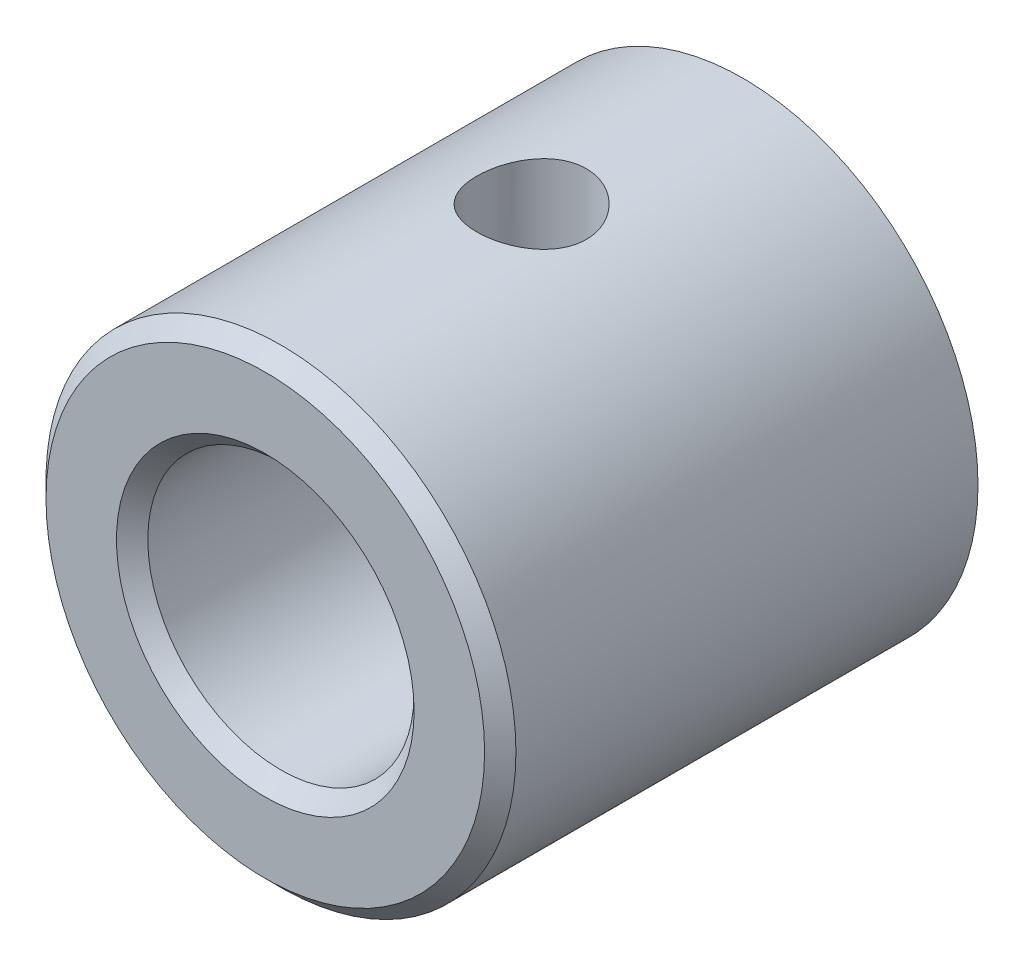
ISO-10303-21;
HEADER;
FILE_DESCRIPTION(('STEP AP214'),'2;1');
FILE_NAME('part.step','',(''),(''),'','','');
FILE_SCHEMA(('AUTOMOTIVE_DESIGN { 1 0 10303 214 1 1 1 1 }'));
ENDSEC;
DATA;
#1=APPLICATION_CONTEXT('core data for automotive mechanical design processes');
#2=APPLICATION_PROTOCOL_DEFINITION('international standard','automotive_design',2000,#1);
#3=PRODUCT_CONTEXT('',#1,'mechanical');
#4=PRODUCT('Part','Part','',(#3));
#5=PRODUCT_RELATED_PRODUCT_CATEGORY('part','',(#4));
#6=PRODUCT_DEFINITION_FORMATION('','',#4);
#7=PRODUCT_DEFINITION_CONTEXT('part definition',#1,'design');
#8=PRODUCT_DEFINITION('design','',#6,#7);
#9=PRODUCT_DEFINITION_SHAPE('','',#8);
#10=(LENGTH_UNIT() NAMED_UNIT(*) SI_UNIT(.MILLI.,.METRE.));
#11=(NAMED_UNIT(*) PLANE_ANGLE_UNIT() SI_UNIT($,.RADIAN.));
#12=(NAMED_UNIT(*) SI_UNIT($,.STERADIAN.) SOLID_ANGLE_UNIT());
#13=UNCERTAINTY_MEASURE_WITH_UNIT(LENGTH_MEASURE(1.E-05),#10,'distance_accuracy_value','');
#14=(GEOMETRIC_REPRESENTATION_CONTEXT(3) GLOBAL_UNCERTAINTY_ASSIGNED_CONTEXT((#13)) GLOBAL_UNIT_ASSIGNED_CONTEXT((#10,
#11,#12)) REPRESENTATION_CONTEXT('',''));
#15=CARTESIAN_POINT('',(0.,0.,0.));
#16=DIRECTION('',(0.,0.,1.));
#17=DIRECTION('',(1.,0.,0.));
#18=AXIS2_PLACEMENT_3D('',#15,#16,#17);
#19=CARTESIAN_POINT('',(0.,0.,30.5));
#20=DIRECTION('',(0.,0.,1.));
#21=DIRECTION('',(1.,0.,0.));
#22=AXIS2_PLACEMENT_3D('',#19,#20,#21);
#23=PLANE('',#22);
#24=CARTESIAN_POINT('',(0.,0.,30.5));
#25=DIRECTION('',(0.,0.,1.));
#26=DIRECTION('',(1.,0.,0.));
#27=AXIS2_PLACEMENT_3D('',#24,#25,#26);
#28=CIRCLE('',#27,9.50000000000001);
#29=CARTESIAN_POINT('',(9.50000000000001,0.,30.5));
#30=VERTEX_POINT('',#29);
#31=EDGE_CURVE('E42',#30,#30,#28,.F.);
#32=ORIENTED_EDGE('',*,*,#31,.T.);
#33=EDGE_LOOP('',(#32));
#34=FACE_BOUND('',#33,.T.);
#35=CARTESIAN_POINT('',(0.,0.,30.5));
#36=DIRECTION('',(0.,0.,1.));
#37=DIRECTION('',(1.,0.,0.));
#38=AXIS2_PLACEMENT_3D('',#35,#36,#37);
#39=CIRCLE('',#38,14.);
#40=CARTESIAN_POINT('',(14.,0.,30.5));
#41=VERTEX_POINT('',#40);
#42=EDGE_CURVE('E47',#41,#41,#39,.T.);
#43=ORIENTED_EDGE('',*,*,#42,.T.);
#44=EDGE_LOOP('',(#43));
#45=FACE_BOUND('',#44,.T.);
#46=ADVANCED_FACE('F30',(#34,#45),#23,.T.);
#47=CARTESIAN_POINT('',(0.,0.,0.));
#48=DIRECTION('',(0.,0.,1.));
#49=DIRECTION('',(1.,0.,0.));
#50=AXIS2_PLACEMENT_3D('',#47,#48,#49);
#51=PLANE('',#50);
#52=CARTESIAN_POINT('',(0.,0.,0.));
#53=DIRECTION('',(0.,0.,1.));
#54=DIRECTION('',(1.,0.,0.));
#55=AXIS2_PLACEMENT_3D('',#52,#53,#54);
#56=CIRCLE('',#55,15.);
#57=CARTESIAN_POINT('',(15.,0.,0.));
#58=VERTEX_POINT('',#57);
#59=EDGE_CURVE('E106',#58,#58,#56,.T.);
#60=ORIENTED_EDGE('',*,*,#59,.F.);
#61=EDGE_LOOP('',(#60));
#62=FACE_BOUND('',#61,.T.);
#63=CARTESIAN_POINT('',(0.,0.,0.));
#64=DIRECTION('',(0.,0.,1.));
#65=DIRECTION('',(1.,0.,0.));
#66=AXIS2_PLACEMENT_3D('',#63,#64,#65);
#67=CIRCLE('',#66,8.5);
#68=CARTESIAN_POINT('',(8.5,0.,0.));
#69=VERTEX_POINT('',#68);
#70=EDGE_CURVE('E110',#69,#69,#67,.T.);
#71=ORIENTED_EDGE('',*,*,#70,.T.);
#72=EDGE_LOOP('',(#71));
#73=FACE_BOUND('',#72,.T.);
#74=ADVANCED_FACE('F80',(#62,#73),#51,.F.);
#75=CARTESIAN_POINT('',(0.,0.,30.5));
#76=DIRECTION('',(0.,0.,-1.));
#77=DIRECTION('',(-1.,0.,0.));
#78=AXIS2_PLACEMENT_3D('',#75,#76,#77);
#79=CYLINDRICAL_SURFACE('',#78,15.);
#80=CARTESIAN_POINT('',(0.,-15.,17.));
#81=CARTESIAN_POINT('',(0.193784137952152,-14.9999965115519,16.9999938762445));
#82=CARTESIAN_POINT('',(0.387639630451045,-14.9962069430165,16.983851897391));
#83=CARTESIAN_POINT('',(0.769821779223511,-14.9814561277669,16.9197908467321));
#84=CARTESIAN_POINT('',(0.958144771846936,-14.9704902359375,16.8718511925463));
#85=CARTESIAN_POINT('',(1.32368533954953,-14.9426047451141,16.7457957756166));
#86=CARTESIAN_POINT('',(1.50091505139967,-14.9256917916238,16.667713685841));
#87=CARTESIAN_POINT('',(1.83975614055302,-14.8877265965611,16.4837020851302));
#88=CARTESIAN_POINT('',(2.00136749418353,-14.866674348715,16.3777725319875));
#89=CARTESIAN_POINT('',(2.30731489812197,-14.8223011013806,16.1390441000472));
#90=CARTESIAN_POINT('',(2.45132761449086,-14.7989487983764,16.0058366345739));
#91=CARTESIAN_POINT('',(2.71518309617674,-14.7528221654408,15.7172097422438));
#92=CARTESIAN_POINT('',(2.83502345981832,-14.7300478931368,15.5617881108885));
#93=CARTESIAN_POINT('',(3.04860129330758,-14.6873442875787,15.230699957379));
#94=CARTESIAN_POINT('',(3.14198666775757,-14.6674549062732,15.0548006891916));
#95=CARTESIAN_POINT('',(3.29774259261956,-14.6332257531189,14.6892632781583));
#96=CARTESIAN_POINT('',(3.36011740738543,-14.6188852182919,14.4996270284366));
#97=CARTESIAN_POINT('',(3.45099741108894,-14.5976976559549,14.1155284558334));
#98=CARTESIAN_POINT('',(3.48007917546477,-14.5907232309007,13.9212097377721));
#99=CARTESIAN_POINT('',(3.50534181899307,-14.5846755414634,13.5303359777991));
#100=CARTESIAN_POINT('',(3.50152732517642,-14.5856011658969,13.3337812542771));
#101=CARTESIAN_POINT('',(3.46156792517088,-14.5951340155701,12.9483602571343));
#102=CARTESIAN_POINT('',(3.42610047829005,-14.6035802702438,12.7594191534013));
#103=CARTESIAN_POINT('',(3.32491859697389,-14.6269472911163,12.3902453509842));
#104=CARTESIAN_POINT('',(3.25920225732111,-14.6418684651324,12.2100132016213));
#105=CARTESIAN_POINT('',(3.09878638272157,-14.6766577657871,11.8615087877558));
#106=CARTESIAN_POINT('',(3.00383300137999,-14.6965689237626,11.6933578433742));
#107=CARTESIAN_POINT('',(2.78781645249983,-14.7390692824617,11.3751288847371));
#108=CARTESIAN_POINT('',(2.66674926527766,-14.7616588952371,11.2250536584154));
#109=CARTESIAN_POINT('',(2.39839030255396,-14.8076557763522,10.9433437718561));
#110=CARTESIAN_POINT('',(2.25052437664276,-14.8310694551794,10.8122564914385));
#111=CARTESIAN_POINT('',(1.9346349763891,-14.8755702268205,10.5766436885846));
#112=CARTESIAN_POINT('',(1.76661103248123,-14.8966572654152,10.4721187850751));
#113=CARTESIAN_POINT('',(1.41445626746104,-14.9342128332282,10.2924332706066));
#114=CARTESIAN_POINT('',(1.23028348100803,-14.9506688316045,10.2173521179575));
#115=CARTESIAN_POINT('',(0.851464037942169,-14.9770161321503,10.0993607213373));
#116=CARTESIAN_POINT('',(0.656819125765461,-14.9869085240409,10.0564451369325));
#117=CARTESIAN_POINT('',(0.267268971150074,-14.9988561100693,10.004817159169));
#118=CARTESIAN_POINT('',(0.0724677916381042,-15.0010823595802,9.99535811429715));
#119=CARTESIAN_POINT('',(-0.315932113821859,-14.9979297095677,10.0088770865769));
#120=CARTESIAN_POINT('',(-0.509530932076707,-14.9925514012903,10.031852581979));
#121=CARTESIAN_POINT('',(-0.887502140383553,-14.9749026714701,10.1089707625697));
#122=CARTESIAN_POINT('',(-1.07196037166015,-14.9627204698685,10.1627147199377));
#123=CARTESIAN_POINT('',(-1.42923974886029,-14.9328310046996,10.2993958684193));
#124=CARTESIAN_POINT('',(-1.60205981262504,-14.9151232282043,10.3823357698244));
#125=CARTESIAN_POINT('',(-1.93419216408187,-14.8757298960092,10.5765607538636));
#126=CARTESIAN_POINT('',(-2.09324620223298,-14.853985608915,10.6882752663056));
#127=CARTESIAN_POINT('',(-2.39061697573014,-14.8090380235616,10.9363204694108));
#128=CARTESIAN_POINT('',(-2.52893061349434,-14.7858345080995,11.0726548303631));
#129=CARTESIAN_POINT('',(-2.7839035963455,-14.7399813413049,11.3695157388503));
#130=CARTESIAN_POINT('',(-2.90004264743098,-14.7173538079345,11.5304932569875));
#131=CARTESIAN_POINT('',(-3.10364669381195,-14.6757697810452,11.8701020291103));
#132=CARTESIAN_POINT('',(-3.1911129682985,-14.6568131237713,12.0487324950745));
#133=CARTESIAN_POINT('',(-3.33426336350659,-14.6249126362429,12.4176011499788));
#134=CARTESIAN_POINT('',(-3.39013314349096,-14.6119337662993,12.6077641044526));
#135=CARTESIAN_POINT('',(-3.46902748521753,-14.5934067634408,12.9951262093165));
#136=CARTESIAN_POINT('',(-3.49205814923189,-14.5878572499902,13.192324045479));
#137=CARTESIAN_POINT('',(-3.50433347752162,-14.584912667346,13.5828913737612));
#138=CARTESIAN_POINT('',(-3.49440587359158,-14.587317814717,13.7762337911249));
#139=CARTESIAN_POINT('',(-3.44291677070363,-14.5995551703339,14.1584075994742));
#140=CARTESIAN_POINT('',(-3.4013557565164,-14.6093872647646,14.3472390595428));
#141=CARTESIAN_POINT('',(-3.28820379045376,-14.6352668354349,14.7142637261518));
#142=CARTESIAN_POINT('',(-3.2167490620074,-14.6512860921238,14.8925010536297));
#143=CARTESIAN_POINT('',(-3.04594967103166,-14.6877426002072,15.2345749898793));
#144=CARTESIAN_POINT('',(-2.94660165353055,-14.7081803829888,15.3984098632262));
#145=CARTESIAN_POINT('',(-2.72015858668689,-14.7517556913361,15.7110727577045));
#146=CARTESIAN_POINT('',(-2.59248054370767,-14.774944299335,15.8594715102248));
#147=CARTESIAN_POINT('',(-2.31416309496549,-14.8210832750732,16.1330076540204));
#148=CARTESIAN_POINT('',(-2.16351833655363,-14.8440335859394,16.2581396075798));
#149=CARTESIAN_POINT('',(-1.84077844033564,-14.8875256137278,16.4834295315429));
#150=CARTESIAN_POINT('',(-1.66839179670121,-14.9080253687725,16.5831785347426));
#151=CARTESIAN_POINT('',(-1.30884565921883,-14.9438767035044,16.7521239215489));
#152=CARTESIAN_POINT('',(-1.12169789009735,-14.9592323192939,16.8213442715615));
#153=CARTESIAN_POINT('',(-0.778820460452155,-14.9805348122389,16.915850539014));
#154=CARTESIAN_POINT('',(-0.624852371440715,-14.9877868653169,16.9473428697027));
#155=CARTESIAN_POINT('',(-0.313938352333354,-14.9975207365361,16.9894194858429));
#156=CARTESIAN_POINT('',(-0.156992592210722,-15.0000028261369,17.0000049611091));
#157=CARTESIAN_POINT('',(0.,-15.,17.));
#158=B_SPLINE_CURVE_WITH_KNOTS('',3,(#80,#81,#82,#83,#84,#85,#86,#87,#88,#89,#90,#91,#92,#93,
#94,#95,#96,#97,#98,#99,#100,#101,#102,#103,#104,#105,#106,#107,#108,#109,#110,#111,#112,#113,
#114,#115,#116,#117,#118,#119,#120,#121,#122,#123,#124,#125,#126,#127,#128,#129,#130,#131,#132,
#133,#134,#135,#136,#137,#138,#139,#140,#141,#142,#143,#144,#145,#146,#147,#148,#149,#150,#151,
#152,#153,#154,#155,#156,#157),.UNSPECIFIED.,.T.,.F.,(4,2,2,2,2,2,2,2,2,2,2,2,2,2,2,2,2,2,2,2,2,
2,2,2,2,2,2,2,2,2,2,2,2,2,2,2,2,2,4),(0.,0.580777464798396,1.16193122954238,1.74243764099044,
2.32294493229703,2.91288378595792,3.50288122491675,4.1003971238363,4.69783083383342,
5.28475364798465,5.87159390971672,6.44616762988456,7.0207775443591,7.60052424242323,
8.18036024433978,8.77452578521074,9.368705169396,9.96447717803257,10.560150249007,
11.1424427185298,11.7246899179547,12.2995572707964,12.8744780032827,13.4585334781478,
14.0426760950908,14.639182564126,15.2356624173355,15.8285999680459,16.4214273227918,
16.9994798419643,17.5775235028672,18.1529612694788,18.7284682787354,19.3171466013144,
19.9059623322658,20.5037373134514,21.1010421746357,21.5715809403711,22.0420929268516),.UNSPECIFIED.);
#159=CARTESIAN_POINT('',(0.,-15.,17.));
#160=VERTEX_POINT('',#159);
#161=EDGE_CURVE('E72',#160,#160,#158,.T.);
#162=ORIENTED_EDGE('',*,*,#161,.T.);
#163=EDGE_LOOP('',(#162));
#164=FACE_BOUND('',#163,.T.);
#165=CARTESIAN_POINT('',(0.,15.,17.));
#166=CARTESIAN_POINT('',(-0.193784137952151,14.9999965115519,16.9999938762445));
#167=CARTESIAN_POINT('',(-0.387639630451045,14.9962069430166,16.983851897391));
#168=CARTESIAN_POINT('',(-0.769821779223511,14.9814561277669,16.9197908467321));
#169=CARTESIAN_POINT('',(-0.958144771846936,14.9704902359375,16.8718511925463));
#170=CARTESIAN_POINT('',(-1.32368533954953,14.9426047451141,16.7457957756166));
#171=CARTESIAN_POINT('',(-1.50091505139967,14.9256917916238,16.667713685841));
#172=CARTESIAN_POINT('',(-1.83975614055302,14.8877265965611,16.4837020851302));
#173=CARTESIAN_POINT('',(-2.00136749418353,14.866674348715,16.3777725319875));
#174=CARTESIAN_POINT('',(-2.30731489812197,14.8223011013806,16.1390441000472));
#175=CARTESIAN_POINT('',(-2.45132761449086,14.7989487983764,16.0058366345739));
#176=CARTESIAN_POINT('',(-2.71518309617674,14.7528221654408,15.7172097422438));
#177=CARTESIAN_POINT('',(-2.83502345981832,14.7300478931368,15.5617881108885));
#178=CARTESIAN_POINT('',(-3.04860129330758,14.6873442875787,15.230699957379));
#179=CARTESIAN_POINT('',(-3.14198666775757,14.6674549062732,15.0548006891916));
#180=CARTESIAN_POINT('',(-3.29774259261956,14.6332257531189,14.6892632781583));
#181=CARTESIAN_POINT('',(-3.36011740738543,14.6188852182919,14.4996270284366));
#182=CARTESIAN_POINT('',(-3.45099741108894,14.5976976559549,14.1155284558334));
#183=CARTESIAN_POINT('',(-3.48007917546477,14.5907232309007,13.9212097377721));
#184=CARTESIAN_POINT('',(-3.50534181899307,14.5846755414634,13.5303359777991));
#185=CARTESIAN_POINT('',(-3.50152732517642,14.5856011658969,13.3337812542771));
#186=CARTESIAN_POINT('',(-3.46156792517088,14.5951340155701,12.9483602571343));
#187=CARTESIAN_POINT('',(-3.42610047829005,14.6035802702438,12.7594191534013));
#188=CARTESIAN_POINT('',(-3.32491859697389,14.6269472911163,12.3902453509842));
#189=CARTESIAN_POINT('',(-3.25920225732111,14.6418684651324,12.2100132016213));
#190=CARTESIAN_POINT('',(-3.09878638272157,14.6766577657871,11.8615087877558));
#191=CARTESIAN_POINT('',(-3.00383300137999,14.6965689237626,11.6933578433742));
#192=CARTESIAN_POINT('',(-2.78781645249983,14.7390692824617,11.3751288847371));
#193=CARTESIAN_POINT('',(-2.66674926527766,14.7616588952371,11.2250536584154));
#194=CARTESIAN_POINT('',(-2.39839030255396,14.8076557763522,10.9433437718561));
#195=CARTESIAN_POINT('',(-2.25052437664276,14.8310694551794,10.8122564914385));
#196=CARTESIAN_POINT('',(-1.9346349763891,14.8755702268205,10.5766436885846));
#197=CARTESIAN_POINT('',(-1.76661103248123,14.8966572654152,10.4721187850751));
#198=CARTESIAN_POINT('',(-1.41445626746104,14.9342128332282,10.2924332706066));
#199=CARTESIAN_POINT('',(-1.23028348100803,14.9506688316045,10.2173521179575));
#200=CARTESIAN_POINT('',(-0.851464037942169,14.9770161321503,10.0993607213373));
#201=CARTESIAN_POINT('',(-0.656819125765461,14.9869085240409,10.0564451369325));
#202=CARTESIAN_POINT('',(-0.267268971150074,14.9988561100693,10.004817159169));
#203=CARTESIAN_POINT('',(-0.0724677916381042,15.0010823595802,9.99535811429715));
#204=CARTESIAN_POINT('',(0.315932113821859,14.9979297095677,10.0088770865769));
#205=CARTESIAN_POINT('',(0.509530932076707,14.9925514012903,10.031852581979));
#206=CARTESIAN_POINT('',(0.887502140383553,14.9749026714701,10.1089707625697));
#207=CARTESIAN_POINT('',(1.07196037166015,14.9627204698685,10.1627147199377));
#208=CARTESIAN_POINT('',(1.42923974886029,14.9328310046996,10.2993958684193));
#209=CARTESIAN_POINT('',(1.60205981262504,14.9151232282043,10.3823357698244));
#210=CARTESIAN_POINT('',(1.93419216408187,14.8757298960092,10.5765607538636));
#211=CARTESIAN_POINT('',(2.09324620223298,14.853985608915,10.6882752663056));
#212=CARTESIAN_POINT('',(2.39061697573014,14.8090380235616,10.9363204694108));
#213=CARTESIAN_POINT('',(2.52893061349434,14.7858345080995,11.0726548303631));
#214=CARTESIAN_POINT('',(2.7839035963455,14.7399813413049,11.3695157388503));
#215=CARTESIAN_POINT('',(2.90004264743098,14.7173538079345,11.5304932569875));
#216=CARTESIAN_POINT('',(3.10364669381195,14.6757697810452,11.8701020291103));
#217=CARTESIAN_POINT('',(3.1911129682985,14.6568131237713,12.0487324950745));
#218=CARTESIAN_POINT('',(3.33426336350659,14.6249126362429,12.4176011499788));
#219=CARTESIAN_POINT('',(3.39013314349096,14.6119337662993,12.6077641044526));
#220=CARTESIAN_POINT('',(3.46902748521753,14.5934067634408,12.9951262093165));
#221=CARTESIAN_POINT('',(3.49205814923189,14.5878572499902,13.192324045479));
#222=CARTESIAN_POINT('',(3.50433347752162,14.584912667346,13.5828913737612));
#223=CARTESIAN_POINT('',(3.49440587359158,14.587317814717,13.7762337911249));
#224=CARTESIAN_POINT('',(3.44291677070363,14.5995551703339,14.1584075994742));
#225=CARTESIAN_POINT('',(3.4013557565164,14.6093872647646,14.3472390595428));
#226=CARTESIAN_POINT('',(3.28820379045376,14.6352668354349,14.7142637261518));
#227=CARTESIAN_POINT('',(3.2167490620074,14.6512860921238,14.8925010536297));
#228=CARTESIAN_POINT('',(3.04594967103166,14.6877426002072,15.2345749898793));
#229=CARTESIAN_POINT('',(2.94660165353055,14.7081803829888,15.3984098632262));
#230=CARTESIAN_POINT('',(2.72015858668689,14.7517556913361,15.7110727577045));
#231=CARTESIAN_POINT('',(2.59248054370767,14.774944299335,15.8594715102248));
#232=CARTESIAN_POINT('',(2.31416309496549,14.8210832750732,16.1330076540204));
#233=CARTESIAN_POINT('',(2.16351833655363,14.8440335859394,16.2581396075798));
#234=CARTESIAN_POINT('',(1.84077844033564,14.8875256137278,16.4834295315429));
#235=CARTESIAN_POINT('',(1.66839179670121,14.9080253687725,16.5831785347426));
#236=CARTESIAN_POINT('',(1.30884565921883,14.9438767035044,16.7521239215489));
#237=CARTESIAN_POINT('',(1.12169789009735,14.9592323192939,16.8213442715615));
#238=CARTESIAN_POINT('',(0.778820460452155,14.9805348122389,16.915850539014));
#239=CARTESIAN_POINT('',(0.624852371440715,14.9877868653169,16.9473428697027));
#240=CARTESIAN_POINT('',(0.313938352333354,14.9975207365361,16.9894194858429));
#241=CARTESIAN_POINT('',(0.156992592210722,15.0000028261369,17.0000049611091));
#242=CARTESIAN_POINT('',(0.,15.,17.));
#243=B_SPLINE_CURVE_WITH_KNOTS('',3,(#165,#166,#167,#168,#169,#170,#171,#172,#173,#174,#175,
#176,#177,#178,#179,#180,#181,#182,#183,#184,#185,#186,#187,#188,#189,#190,#191,#192,#193,#194,
#195,#196,#197,#198,#199,#200,#201,#202,#203,#204,#205,#206,#207,#208,#209,#210,#211,#212,#213,
#214,#215,#216,#217,#218,#219,#220,#221,#222,#223,#224,#225,#226,#227,#228,#229,#230,#231,#232,
#233,#234,#235,#236,#237,#238,#239,#240,#241,#242),.UNSPECIFIED.,.T.,.F.,(4,2,2,2,2,2,2,2,2,2,2,
2,2,2,2,2,2,2,2,2,2,2,2,2,2,2,2,2,2,2,2,2,2,2,2,2,2,2,4),(0.,0.580777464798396,1.16193122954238,
1.74243764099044,2.32294493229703,2.91288378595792,3.50288122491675,4.1003971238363,
4.69783083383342,5.28475364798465,5.87159390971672,6.44616762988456,7.0207775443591,
7.60052424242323,8.18036024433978,8.77452578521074,9.368705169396,9.96447717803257,
10.560150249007,11.1424427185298,11.7246899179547,12.2995572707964,12.8744780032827,
13.4585334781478,14.0426760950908,14.639182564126,15.2356624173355,15.8285999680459,
16.4214273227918,16.9994798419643,17.5775235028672,18.1529612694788,18.7284682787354,
19.3171466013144,19.9059623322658,20.5037373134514,21.1010421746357,21.5715809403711,
22.0420929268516),.UNSPECIFIED.);
#244=CARTESIAN_POINT('',(0.,15.,17.));
#245=VERTEX_POINT('',#244);
#246=EDGE_CURVE('E67',#245,#245,#243,.T.);
#247=ORIENTED_EDGE('',*,*,#246,.T.);
#248=EDGE_LOOP('',(#247));
#249=FACE_BOUND('',#248,.T.);
#250=CARTESIAN_POINT('',(0.,0.,29.5));
#251=DIRECTION('',(0.,0.,1.));
#252=DIRECTION('',(1.,0.,0.));
#253=AXIS2_PLACEMENT_3D('',#250,#251,#252);
#254=CIRCLE('',#253,15.);
#255=CARTESIAN_POINT('',(15.,0.,29.5));
#256=VERTEX_POINT('',#255);
#257=EDGE_CURVE('E10',#256,#256,#254,.F.);
#258=ORIENTED_EDGE('',*,*,#257,.T.);
#259=EDGE_LOOP('',(#258));
#260=FACE_BOUND('',#259,.T.);
#261=ORIENTED_EDGE('',*,*,#59,.T.);
#262=EDGE_LOOP('',(#261));
#263=FACE_BOUND('',#262,.T.);
#264=ADVANCED_FACE('F76',(#164,#249,#260,#263),#79,.T.);
#265=CARTESIAN_POINT('',(0.,0.,30.5));
#266=DIRECTION('',(0.,0.,-1.));
#267=DIRECTION('',(-1.,0.,0.));
#268=AXIS2_PLACEMENT_3D('',#265,#266,#267);
#269=CYLINDRICAL_SURFACE('',#268,8.5);
#270=CARTESIAN_POINT('',(0.,-8.5,17.));
#271=CARTESIAN_POINT('',(0.0938749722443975,-8.49999950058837,16.9999993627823));
#272=CARTESIAN_POINT('',(0.187783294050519,-8.49844045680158,16.9962178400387));
#273=CARTESIAN_POINT('',(0.374931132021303,-8.4922438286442,16.9811278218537));
#274=CARTESIAN_POINT('',(0.46817017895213,-8.4876042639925,16.9698144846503));
#275=CARTESIAN_POINT('',(0.653450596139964,-8.47535440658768,16.9397417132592));
#276=CARTESIAN_POINT('',(0.745489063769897,-8.46773793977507,16.9209668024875));
#277=CARTESIAN_POINT('',(0.927519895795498,-8.449739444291,16.8761679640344));
#278=CARTESIAN_POINT('',(1.01751140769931,-8.4393562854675,16.8501410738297));
#279=CARTESIAN_POINT('',(1.28280898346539,-8.40452287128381,16.7617454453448));
#280=CARTESIAN_POINT('',(1.45427249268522,-8.37632994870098,16.6889241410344));
#281=CARTESIAN_POINT('',(1.78229858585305,-8.31272657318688,16.5178953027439));
#282=CARTESIAN_POINT('',(1.9388658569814,-8.27731840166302,16.4196957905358));
#283=CARTESIAN_POINT('',(2.24073162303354,-8.2008796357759,16.1955541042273));
#284=CARTESIAN_POINT('',(2.38520573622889,-8.15966771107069,16.0685621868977));
#285=CARTESIAN_POINT('',(2.65150542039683,-8.07706659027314,15.7926661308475));
#286=CARTESIAN_POINT('',(2.7733193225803,-8.03567731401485,15.6437507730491));
#287=CARTESIAN_POINT('',(2.99659603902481,-7.95519850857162,15.3196012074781));
#288=CARTESIAN_POINT('',(3.09680811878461,-7.91631340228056,15.1434493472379));
#289=CARTESIAN_POINT('',(3.26581094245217,-7.84811106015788,14.7749541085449));
#290=CARTESIAN_POINT('',(3.33461749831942,-7.81878901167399,14.5826189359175));
#291=CARTESIAN_POINT('',(3.43546868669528,-7.77498977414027,14.1967145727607));
#292=CARTESIAN_POINT('',(3.46909973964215,-7.75987541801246,14.003635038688));
#293=CARTESIAN_POINT('',(3.50359653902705,-7.74436614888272,13.6140272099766));
#294=CARTESIAN_POINT('',(3.50447975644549,-7.74396338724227,13.4175008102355));
#295=CARTESIAN_POINT('',(3.4746529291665,-7.75738227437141,13.042209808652));
#296=CARTESIAN_POINT('',(3.44629270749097,-7.77014597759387,12.8632130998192));
#297=CARTESIAN_POINT('',(3.36271856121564,-7.80667544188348,12.5127901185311));
#298=CARTESIAN_POINT('',(3.30749963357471,-7.8304432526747,12.3413652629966));
#299=CARTESIAN_POINT('',(3.17070558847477,-7.88683570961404,12.0066784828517));
#300=CARTESIAN_POINT('',(3.08860050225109,-7.9196361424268,11.8436641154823));
#301=CARTESIAN_POINT('',(2.90073866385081,-7.99035494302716,11.5331030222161));
#302=CARTESIAN_POINT('',(2.79497271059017,-8.02827529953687,11.3855623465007));
#303=CARTESIAN_POINT('',(2.55256267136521,-8.10876167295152,11.0973494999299));
#304=CARTESIAN_POINT('',(2.41409301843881,-8.15145310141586,10.9582435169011));
#305=CARTESIAN_POINT('',(2.11535788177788,-8.23403055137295,10.7047091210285));
#306=CARTESIAN_POINT('',(1.95508753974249,-8.273915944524,10.5902862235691));
#307=CARTESIAN_POINT('',(1.61263582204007,-8.34749682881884,10.3871422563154));
#308=CARTESIAN_POINT('',(1.43004903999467,-8.38103633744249,10.2990439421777));
#309=CARTESIAN_POINT('',(1.05091358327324,-8.43695476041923,10.1553602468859));
#310=CARTESIAN_POINT('',(0.854372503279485,-8.45933969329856,10.0997573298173));
#311=CARTESIAN_POINT('',(0.466007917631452,-8.48931065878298,10.0258878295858));
#312=CARTESIAN_POINT('',(0.27464845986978,-8.49772880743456,10.0055185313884));
#313=CARTESIAN_POINT('',(-0.108922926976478,-8.50146338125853,9.99644352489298));
#314=CARTESIAN_POINT('',(-0.301134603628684,-8.49678345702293,10.0077289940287));
#315=CARTESIAN_POINT('',(-0.671202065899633,-8.47538904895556,10.0601253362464));
#316=CARTESIAN_POINT('',(-0.849303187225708,-8.45926569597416,10.0997719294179));
#317=CARTESIAN_POINT('',(-1.1961404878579,-8.41723157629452,10.2057407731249));
#318=CARTESIAN_POINT('',(-1.36487547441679,-8.39131956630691,10.2720664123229));
#319=CARTESIAN_POINT('',(-1.69408014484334,-8.33120470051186,10.4316789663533));
#320=CARTESIAN_POINT('',(-1.85413233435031,-8.29677004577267,10.5257368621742));
#321=CARTESIAN_POINT('',(-2.15675181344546,-8.22330284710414,10.7372945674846));
#322=CARTESIAN_POINT('',(-2.29931184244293,-8.18426840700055,10.8548040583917));
#323=CARTESIAN_POINT('',(-2.57336207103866,-8.1024483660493,11.1195404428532));
#324=CARTESIAN_POINT('',(-2.70338322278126,-8.05959121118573,11.2682698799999));
#325=CARTESIAN_POINT('',(-2.93701683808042,-7.97742494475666,11.5861436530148));
#326=CARTESIAN_POINT('',(-3.04062381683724,-7.93811657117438,11.7552922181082));
#327=CARTESIAN_POINT('',(-3.21946202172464,-7.86730426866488,12.1124033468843));
#328=CARTESIAN_POINT('',(-3.29431217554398,-7.83590692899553,12.3005794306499));
#329=CARTESIAN_POINT('',(-3.41064392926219,-7.78598679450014,12.6885591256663));
#330=CARTESIAN_POINT('',(-3.45215217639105,-7.76745372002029,12.888353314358));
#331=CARTESIAN_POINT('',(-3.49800353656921,-7.7469054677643,13.2776387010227));
#332=CARTESIAN_POINT('',(-3.50491667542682,-7.74374853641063,13.466768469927));
#333=CARTESIAN_POINT('',(-3.48820937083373,-7.75128899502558,13.8433736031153));
#334=CARTESIAN_POINT('',(-3.46459335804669,-7.76198437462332,14.0308492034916));
#335=CARTESIAN_POINT('',(-3.38963985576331,-7.794991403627,14.3902606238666));
#336=CARTESIAN_POINT('',(-3.33957990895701,-7.81676614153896,14.562516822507));
#337=CARTESIAN_POINT('',(-3.21439168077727,-7.86907002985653,14.896234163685));
#338=CARTESIAN_POINT('',(-3.13925638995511,-7.89960162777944,15.0576922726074));
#339=CARTESIAN_POINT('',(-2.96091478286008,-7.9682255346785,15.3756767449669));
#340=CARTESIAN_POINT('',(-2.85630774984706,-8.0066588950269,15.5313424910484));
#341=CARTESIAN_POINT('',(-2.62397017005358,-8.08577889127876,15.8237182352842));
#342=CARTESIAN_POINT('',(-2.49623191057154,-8.12646627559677,15.9604218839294));
#343=CARTESIAN_POINT('',(-2.21060451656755,-8.20894898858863,16.2208776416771));
#344=CARTESIAN_POINT('',(-2.05122561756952,-8.25062057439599,16.3430398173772));
#345=CARTESIAN_POINT('',(-1.71256184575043,-8.3274946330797,16.5589855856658));
#346=CARTESIAN_POINT('',(-1.53326791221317,-8.36269414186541,16.6527561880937));
#347=CARTESIAN_POINT('',(-1.2548949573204,-8.40737492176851,16.7688177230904));
#348=CARTESIAN_POINT('',(-1.16133599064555,-8.4208373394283,16.8032215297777));
#349=CARTESIAN_POINT('',(-0.971298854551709,-8.44486361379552,16.8640019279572));
#350=CARTESIAN_POINT('',(-0.874822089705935,-8.4554288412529,16.890382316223));
#351=CARTESIAN_POINT('',(-0.679933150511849,-8.473325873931,16.9347723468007));
#352=CARTESIAN_POINT('',(-0.581526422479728,-8.48066570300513,16.9528027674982));
#353=CARTESIAN_POINT('',(-0.383385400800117,-8.49192824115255,16.9803743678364));
#354=CARTESIAN_POINT('',(-0.283652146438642,-8.49585348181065,16.9899218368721));
#355=CARTESIAN_POINT('',(-0.153110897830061,-8.49867614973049,16.9967837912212));
#356=CARTESIAN_POINT('',(-0.122504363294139,-8.49917233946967,16.9979895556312));
#357=CARTESIAN_POINT('',(-0.0612664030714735,-8.49983434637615,16.9995977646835));
#358=CARTESIAN_POINT('',(-0.0306349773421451,-8.50000016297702,17.0000002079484));
#359=CARTESIAN_POINT('',(0.,-8.5,17.));
#360=B_SPLINE_CURVE_WITH_KNOTS('',3,(#270,#271,#272,#273,#274,#275,#276,#277,#278,#279,#280,
#281,#282,#283,#284,#285,#286,#287,#288,#289,#290,#291,#292,#293,#294,#295,#296,#297,#298,#299,
#300,#301,#302,#303,#304,#305,#306,#307,#308,#309,#310,#311,#312,#313,#314,#315,#316,#317,#318,
#319,#320,#321,#322,#323,#324,#325,#326,#327,#328,#329,#330,#331,#332,#333,#334,#335,#336,#337,
#338,#339,#340,#341,#342,#343,#344,#345,#346,#347,#348,#349,#350,#351,#352,#353,#354,#355,#356,
#357,#358,#359),.UNSPECIFIED.,.T.,.F.,(4,2,2,2,2,2,2,2,2,2,2,2,2,2,2,2,2,2,2,2,2,2,2,2,2,2,2,2,
2,2,2,2,2,2,2,2,2,2,2,2,2,2,2,2,4),(0.,0.281593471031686,0.563368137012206,0.845730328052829,
1.1282080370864,1.69065248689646,2.25291937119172,2.8404935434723,3.42836945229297,
4.04433898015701,4.65999803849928,5.24650545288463,5.83269996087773,6.37520384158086,
6.91780881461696,7.47182746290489,8.02606193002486,8.62593789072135,9.22594775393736,
9.83919559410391,10.4521121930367,11.0269957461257,11.6017190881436,12.1487319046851,
12.6958142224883,13.259830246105,13.8240795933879,14.4277466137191,15.0315388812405,
15.6430769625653,16.2541258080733,16.8190273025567,17.3838468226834,17.9235854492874,
18.4634750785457,19.0353891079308,19.607494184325,20.2198864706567,20.8325585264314,
21.133993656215,21.4352859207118,21.735824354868,22.036139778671,22.1280342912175,
22.2199289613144),.UNSPECIFIED.);
#361=CARTESIAN_POINT('',(0.,-8.5,17.));
#362=VERTEX_POINT('',#361);
#363=EDGE_CURVE('E34',#362,#362,#360,.T.);
#364=ORIENTED_EDGE('',*,*,#363,.F.);
#365=EDGE_LOOP('',(#364));
#366=FACE_BOUND('',#365,.T.);
#367=CARTESIAN_POINT('',(0.,8.50000000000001,17.));
#368=CARTESIAN_POINT('',(-0.0938749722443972,8.49999950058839,16.9999993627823));
#369=CARTESIAN_POINT('',(-0.187783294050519,8.49844045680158,16.9962178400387));
#370=CARTESIAN_POINT('',(-0.374931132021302,8.49224382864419,16.9811278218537));
#371=CARTESIAN_POINT('',(-0.468170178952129,8.4876042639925,16.9698144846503));
#372=CARTESIAN_POINT('',(-0.653450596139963,8.47535440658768,16.9397417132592));
#373=CARTESIAN_POINT('',(-0.745489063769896,8.46773793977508,16.9209668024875));
#374=CARTESIAN_POINT('',(-0.927519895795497,8.449739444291,16.8761679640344));
#375=CARTESIAN_POINT('',(-1.01751140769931,8.4393562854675,16.8501410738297));
#376=CARTESIAN_POINT('',(-1.28280898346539,8.40452287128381,16.7617454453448));
#377=CARTESIAN_POINT('',(-1.45427249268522,8.37632994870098,16.6889241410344));
#378=CARTESIAN_POINT('',(-1.78229858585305,8.31272657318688,16.5178953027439));
#379=CARTESIAN_POINT('',(-1.9388658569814,8.27731840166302,16.4196957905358));
#380=CARTESIAN_POINT('',(-2.24073162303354,8.2008796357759,16.1955541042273));
#381=CARTESIAN_POINT('',(-2.38520573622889,8.15966771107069,16.0685621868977));
#382=CARTESIAN_POINT('',(-2.65150542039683,8.07706659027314,15.7926661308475));
#383=CARTESIAN_POINT('',(-2.7733193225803,8.03567731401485,15.6437507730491));
#384=CARTESIAN_POINT('',(-2.99659603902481,7.95519850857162,15.3196012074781));
#385=CARTESIAN_POINT('',(-3.09680811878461,7.91631340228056,15.1434493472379));
#386=CARTESIAN_POINT('',(-3.26581094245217,7.84811106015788,14.7749541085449));
#387=CARTESIAN_POINT('',(-3.33461749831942,7.81878901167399,14.5826189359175));
#388=CARTESIAN_POINT('',(-3.43546868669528,7.77498977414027,14.1967145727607));
#389=CARTESIAN_POINT('',(-3.46909973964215,7.75987541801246,14.003635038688));
#390=CARTESIAN_POINT('',(-3.50359653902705,7.74436614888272,13.6140272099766));
#391=CARTESIAN_POINT('',(-3.50447975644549,7.74396338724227,13.4175008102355));
#392=CARTESIAN_POINT('',(-3.4746529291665,7.75738227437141,13.042209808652));
#393=CARTESIAN_POINT('',(-3.44629270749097,7.77014597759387,12.8632130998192));
#394=CARTESIAN_POINT('',(-3.36271856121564,7.80667544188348,12.5127901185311));
#395=CARTESIAN_POINT('',(-3.30749963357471,7.8304432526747,12.3413652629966));
#396=CARTESIAN_POINT('',(-3.17070558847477,7.88683570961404,12.0066784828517));
#397=CARTESIAN_POINT('',(-3.08860050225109,7.9196361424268,11.8436641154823));
#398=CARTESIAN_POINT('',(-2.90073866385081,7.99035494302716,11.5331030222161));
#399=CARTESIAN_POINT('',(-2.79497271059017,8.02827529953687,11.3855623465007));
#400=CARTESIAN_POINT('',(-2.55256267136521,8.10876167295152,11.0973494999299));
#401=CARTESIAN_POINT('',(-2.41409301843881,8.15145310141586,10.9582435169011));
#402=CARTESIAN_POINT('',(-2.11535788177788,8.23403055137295,10.7047091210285));
#403=CARTESIAN_POINT('',(-1.9550875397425,8.273915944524,10.5902862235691));
#404=CARTESIAN_POINT('',(-1.61263582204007,8.34749682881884,10.3871422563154));
#405=CARTESIAN_POINT('',(-1.43004903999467,8.38103633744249,10.2990439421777));
#406=CARTESIAN_POINT('',(-1.05091358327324,8.43695476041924,10.1553602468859));
#407=CARTESIAN_POINT('',(-0.854372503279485,8.45933969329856,10.0997573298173));
#408=CARTESIAN_POINT('',(-0.466007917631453,8.48931065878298,10.0258878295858));
#409=CARTESIAN_POINT('',(-0.274648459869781,8.49772880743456,10.0055185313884));
#410=CARTESIAN_POINT('',(0.108922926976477,8.50146338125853,9.99644352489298));
#411=CARTESIAN_POINT('',(0.301134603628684,8.49678345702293,10.0077289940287));
#412=CARTESIAN_POINT('',(0.671202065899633,8.47538904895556,10.0601253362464));
#413=CARTESIAN_POINT('',(0.849303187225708,8.45926569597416,10.0997719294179));
#414=CARTESIAN_POINT('',(1.1961404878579,8.41723157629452,10.2057407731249));
#415=CARTESIAN_POINT('',(1.36487547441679,8.39131956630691,10.2720664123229));
#416=CARTESIAN_POINT('',(1.69408014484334,8.33120470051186,10.4316789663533));
#417=CARTESIAN_POINT('',(1.85413233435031,8.29677004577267,10.5257368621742));
#418=CARTESIAN_POINT('',(2.15675181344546,8.22330284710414,10.7372945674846));
#419=CARTESIAN_POINT('',(2.29931184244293,8.18426840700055,10.8548040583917));
#420=CARTESIAN_POINT('',(2.57336207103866,8.1024483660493,11.1195404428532));
#421=CARTESIAN_POINT('',(2.70338322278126,8.05959121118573,11.2682698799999));
#422=CARTESIAN_POINT('',(2.93701683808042,7.97742494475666,11.5861436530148));
#423=CARTESIAN_POINT('',(3.04062381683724,7.93811657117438,11.7552922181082));
#424=CARTESIAN_POINT('',(3.21946202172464,7.86730426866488,12.1124033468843));
#425=CARTESIAN_POINT('',(3.29431217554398,7.83590692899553,12.3005794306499));
#426=CARTESIAN_POINT('',(3.41064392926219,7.78598679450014,12.6885591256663));
#427=CARTESIAN_POINT('',(3.45215217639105,7.76745372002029,12.888353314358));
#428=CARTESIAN_POINT('',(3.49800353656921,7.7469054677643,13.2776387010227));
#429=CARTESIAN_POINT('',(3.50491667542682,7.74374853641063,13.466768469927));
#430=CARTESIAN_POINT('',(3.48820937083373,7.75128899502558,13.8433736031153));
#431=CARTESIAN_POINT('',(3.46459335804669,7.76198437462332,14.0308492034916));
#432=CARTESIAN_POINT('',(3.38963985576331,7.794991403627,14.3902606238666));
#433=CARTESIAN_POINT('',(3.33957990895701,7.81676614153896,14.562516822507));
#434=CARTESIAN_POINT('',(3.21439168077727,7.86907002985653,14.896234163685));
#435=CARTESIAN_POINT('',(3.13925638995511,7.89960162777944,15.0576922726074));
#436=CARTESIAN_POINT('',(2.96091478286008,7.9682255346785,15.3756767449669));
#437=CARTESIAN_POINT('',(2.85630774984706,8.0066588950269,15.5313424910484));
#438=CARTESIAN_POINT('',(2.62397017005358,8.08577889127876,15.8237182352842));
#439=CARTESIAN_POINT('',(2.49623191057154,8.12646627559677,15.9604218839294));
#440=CARTESIAN_POINT('',(2.21060451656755,8.20894898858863,16.2208776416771));
#441=CARTESIAN_POINT('',(2.05122561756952,8.25062057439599,16.3430398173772));
#442=CARTESIAN_POINT('',(1.71256184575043,8.3274946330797,16.5589855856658));
#443=CARTESIAN_POINT('',(1.53326791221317,8.36269414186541,16.6527561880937));
#444=CARTESIAN_POINT('',(1.2548949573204,8.40737492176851,16.7688177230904));
#445=CARTESIAN_POINT('',(1.16133599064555,8.4208373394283,16.8032215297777));
#446=CARTESIAN_POINT('',(0.97129885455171,8.44486361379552,16.8640019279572));
#447=CARTESIAN_POINT('',(0.874822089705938,8.4554288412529,16.890382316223));
#448=CARTESIAN_POINT('',(0.679933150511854,8.473325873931,16.9347723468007));
#449=CARTESIAN_POINT('',(0.581526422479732,8.48066570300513,16.9528027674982));
#450=CARTESIAN_POINT('',(0.38338540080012,8.49192824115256,16.9803743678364));
#451=CARTESIAN_POINT('',(0.283652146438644,8.49585348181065,16.9899218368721));
#452=CARTESIAN_POINT('',(0.153110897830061,8.49867614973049,16.9967837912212));
#453=CARTESIAN_POINT('',(0.122504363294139,8.49917233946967,16.9979895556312));
#454=CARTESIAN_POINT('',(0.0612664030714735,8.49983434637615,16.9995977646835));
#455=CARTESIAN_POINT('',(0.0306349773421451,8.50000016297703,17.0000002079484));
#456=CARTESIAN_POINT('',(0.,8.50000000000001,17.));
#457=B_SPLINE_CURVE_WITH_KNOTS('',3,(#367,#368,#369,#370,#371,#372,#373,#374,#375,#376,#377,
#378,#379,#380,#381,#382,#383,#384,#385,#386,#387,#388,#389,#390,#391,#392,#393,#394,#395,#396,
#397,#398,#399,#400,#401,#402,#403,#404,#405,#406,#407,#408,#409,#410,#411,#412,#413,#414,#415,
#416,#417,#418,#419,#420,#421,#422,#423,#424,#425,#426,#427,#428,#429,#430,#431,#432,#433,#434,
#435,#436,#437,#438,#439,#440,#441,#442,#443,#444,#445,#446,#447,#448,#449,#450,#451,#452,#453,
#454,#455,#456),.UNSPECIFIED.,.T.,.F.,(4,2,2,2,2,2,2,2,2,2,2,2,2,2,2,2,2,2,2,2,2,2,2,2,2,2,2,2,
2,2,2,2,2,2,2,2,2,2,2,2,2,2,2,2,4),(0.,0.281593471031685,0.563368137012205,0.845730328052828,
1.1282080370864,1.69065248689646,2.25291937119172,2.8404935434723,3.42836945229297,
4.04433898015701,4.65999803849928,5.24650545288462,5.83269996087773,6.37520384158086,
6.91780881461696,7.47182746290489,8.02606193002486,8.62593789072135,9.22594775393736,
9.83919559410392,10.4521121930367,11.0269957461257,11.6017190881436,12.1487319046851,
12.6958142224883,13.259830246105,13.8240795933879,14.4277466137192,15.0315388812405,
15.6430769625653,16.2541258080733,16.8190273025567,17.3838468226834,17.9235854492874,
18.4634750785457,19.0353891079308,19.607494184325,20.2198864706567,20.8325585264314,
21.133993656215,21.4352859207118,21.735824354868,22.036139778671,22.1280342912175,
22.2199289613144),.UNSPECIFIED.);
#458=CARTESIAN_POINT('',(0.,8.50000000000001,17.));
#459=VERTEX_POINT('',#458);
#460=EDGE_CURVE('E50',#459,#459,#457,.T.);
#461=ORIENTED_EDGE('',*,*,#460,.F.);
#462=EDGE_LOOP('',(#461));
#463=FACE_BOUND('',#462,.T.);
#464=CARTESIAN_POINT('',(0.,0.,29.5));
#465=DIRECTION('',(0.,0.,1.));
#466=DIRECTION('',(1.,0.,0.));
#467=AXIS2_PLACEMENT_3D('',#464,#465,#466);
#468=CIRCLE('',#467,8.5);
#469=CARTESIAN_POINT('',(8.5,0.,29.5));
#470=VERTEX_POINT('',#469);
#471=EDGE_CURVE('E104',#470,#470,#468,.T.);
#472=ORIENTED_EDGE('',*,*,#471,.T.);
#473=EDGE_LOOP('',(#472));
#474=FACE_BOUND('',#473,.T.);
#475=ORIENTED_EDGE('',*,*,#70,.F.);
#476=EDGE_LOOP('',(#475));
#477=FACE_BOUND('',#476,.T.);
#478=ADVANCED_FACE('F54',(#366,#463,#474,#477),#269,.F.);
#479=CARTESIAN_POINT('',(0.,0.,29.5));
#480=DIRECTION('',(0.,0.,1.));
#481=DIRECTION('',(1.,0.,0.));
#482=AXIS2_PLACEMENT_3D('',#479,#480,#481);
#483=CONICAL_SURFACE('',#482,8.5,0.785398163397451);
#484=ORIENTED_EDGE('',*,*,#31,.F.);
#485=EDGE_LOOP('',(#484));
#486=FACE_BOUND('',#485,.T.);
#487=ORIENTED_EDGE('',*,*,#471,.F.);
#488=EDGE_LOOP('',(#487));
#489=FACE_BOUND('',#488,.T.);
#490=ADVANCED_FACE('F82',(#486,#489),#483,.F.);
#491=CARTESIAN_POINT('',(0.,0.,30.5));
#492=DIRECTION('',(0.,0.,-1.));
#493=DIRECTION('',(-1.,0.,0.));
#494=AXIS2_PLACEMENT_3D('',#491,#492,#493);
#495=CONICAL_SURFACE('',#494,14.,0.785398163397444);
#496=ORIENTED_EDGE('',*,*,#257,.F.);
#497=EDGE_LOOP('',(#496));
#498=FACE_BOUND('',#497,.T.);
#499=ORIENTED_EDGE('',*,*,#42,.F.);
#500=EDGE_LOOP('',(#499));
#501=FACE_BOUND('',#500,.T.);
#502=ADVANCED_FACE('F32',(#498,#501),#495,.T.);
#503=CARTESIAN_POINT('',(0.,-20.,13.5));
#504=DIRECTION('',(0.,1.,0.));
#505=DIRECTION('',(0.,0.,1.));
#506=AXIS2_PLACEMENT_3D('',#503,#504,#505);
#507=CYLINDRICAL_SURFACE('',#506,3.5);
#508=ORIENTED_EDGE('',*,*,#460,.T.);
#509=EDGE_LOOP('',(#508));
#510=FACE_BOUND('',#509,.T.);
#511=ORIENTED_EDGE('',*,*,#246,.F.);
#512=EDGE_LOOP('',(#511));
#513=FACE_BOUND('',#512,.T.);
#514=ADVANCED_FACE('F60',(#510,#513),#507,.F.);
#515=ORIENTED_EDGE('',*,*,#363,.T.);
#516=EDGE_LOOP('',(#515));
#517=FACE_BOUND('',#516,.T.);
#518=ORIENTED_EDGE('',*,*,#161,.F.);
#519=EDGE_LOOP('',(#518));
#520=FACE_BOUND('',#519,.T.);
#521=ADVANCED_FACE('F57',(#517,#520),#507,.F.);
#522=CLOSED_SHELL('',(#46,#74,#264,#478,#490,#502,#514,#521));
#523=MANIFOLD_SOLID_BREP('B2',#522);
#524=ADVANCED_BREP_SHAPE_REPRESENTATION('',(#18,#523),#14);
#525=SHAPE_DEFINITION_REPRESENTATION(#9,#524);
ENDSEC;
END-ISO-10303-21;
